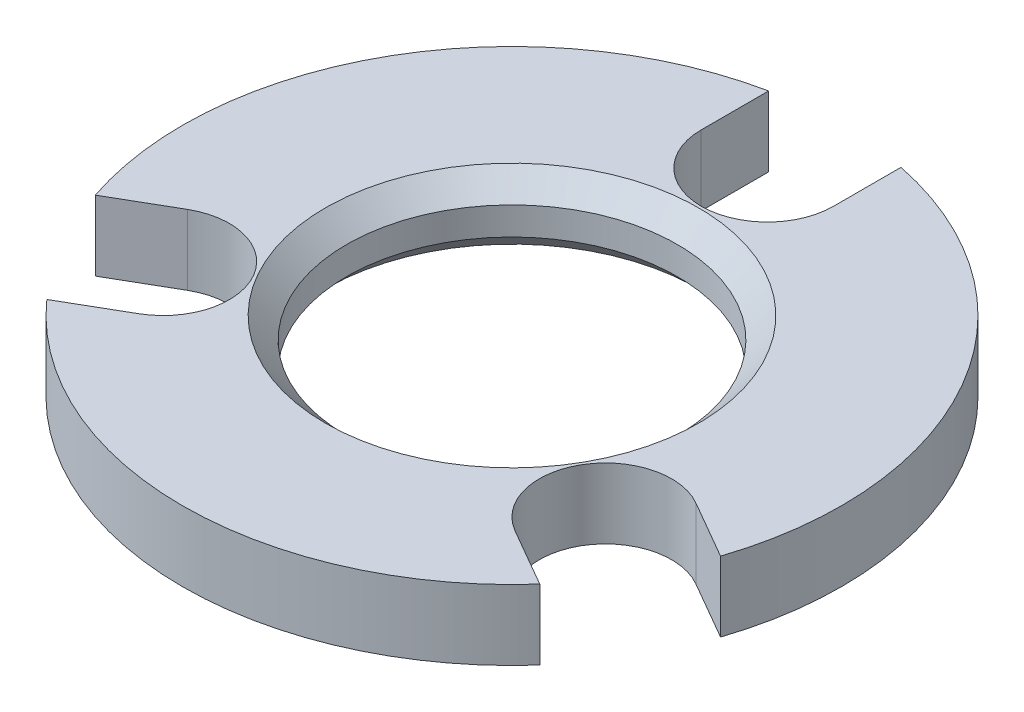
ISO-10303-21;
HEADER;
FILE_DESCRIPTION(('STEP AP214'),'2;1');
FILE_NAME('part.step','',(''),(''),'','','');
FILE_SCHEMA(('AUTOMOTIVE_DESIGN { 1 0 10303 214 1 1 1 1 }'));
ENDSEC;
DATA;
#1=APPLICATION_CONTEXT('core data for automotive mechanical design processes');
#2=APPLICATION_PROTOCOL_DEFINITION('international standard','automotive_design',2000,#1);
#3=PRODUCT_CONTEXT('',#1,'mechanical');
#4=PRODUCT('Part','Part','',(#3));
#5=PRODUCT_RELATED_PRODUCT_CATEGORY('part','',(#4));
#6=PRODUCT_DEFINITION_FORMATION('','',#4);
#7=PRODUCT_DEFINITION_CONTEXT('part definition',#1,'design');
#8=PRODUCT_DEFINITION('design','',#6,#7);
#9=PRODUCT_DEFINITION_SHAPE('','',#8);
#10=(LENGTH_UNIT() NAMED_UNIT(*) SI_UNIT(.MILLI.,.METRE.));
#11=(NAMED_UNIT(*) PLANE_ANGLE_UNIT() SI_UNIT($,.RADIAN.));
#12=(NAMED_UNIT(*) SI_UNIT($,.STERADIAN.) SOLID_ANGLE_UNIT());
#13=UNCERTAINTY_MEASURE_WITH_UNIT(LENGTH_MEASURE(1.E-05),#10,'distance_accuracy_value','');
#14=(GEOMETRIC_REPRESENTATION_CONTEXT(3) GLOBAL_UNCERTAINTY_ASSIGNED_CONTEXT((#13)) GLOBAL_UNIT_ASSIGNED_CONTEXT((#10,
#11,#12)) REPRESENTATION_CONTEXT('',''));
#15=CARTESIAN_POINT('',(0.,0.,0.));
#16=DIRECTION('',(0.,0.,1.));
#17=DIRECTION('',(1.,0.,0.));
#18=AXIS2_PLACEMENT_3D('',#15,#16,#17);
#19=CARTESIAN_POINT('',(0.,6.731,0.));
#20=DIRECTION('',(0.,-1.,0.));
#21=DIRECTION('',(0.,0.,-1.));
#22=AXIS2_PLACEMENT_3D('',#19,#20,#21);
#23=CYLINDRICAL_SURFACE('',#22,31.623);
#24=CARTESIAN_POINT('',(0.,6.731,0.));
#25=DIRECTION('',(0.,1.,0.));
#26=DIRECTION('',(0.,0.,1.));
#27=AXIS2_PLACEMENT_3D('',#24,#25,#26);
#28=CIRCLE('',#27,31.623);
#29=CARTESIAN_POINT('',(-23.6535057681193,6.731,20.98870634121));
#30=VERTEX_POINT('',#29);
#31=CARTESIAN_POINT('',(23.653505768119,6.731,20.9887063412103));
#32=VERTEX_POINT('',#31);
#33=EDGE_CURVE('E56',#30,#32,#28,.T.);
#34=ORIENTED_EDGE('',*,*,#33,.F.);
#35=DIRECTION('',(0.,-1.,0.));
#36=VECTOR('',#35,1.);
#37=CARTESIAN_POINT('',(-23.6535057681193,6.731,20.98870634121));
#38=LINE('',#37,#36);
#39=CARTESIAN_POINT('',(-23.6535057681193,0.,20.98870634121));
#40=VERTEX_POINT('',#39);
#41=EDGE_CURVE('E218',#30,#40,#38,.T.);
#42=ORIENTED_EDGE('',*,*,#41,.T.);
#43=CARTESIAN_POINT('',(0.,0.,0.));
#44=DIRECTION('',(0.,1.,0.));
#45=DIRECTION('',(0.,0.,1.));
#46=AXIS2_PLACEMENT_3D('',#43,#44,#45);
#47=CIRCLE('',#46,31.623);
#48=CARTESIAN_POINT('',(23.653505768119,0.,20.9887063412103));
#49=VERTEX_POINT('',#48);
#50=EDGE_CURVE('E205',#40,#49,#47,.T.);
#51=ORIENTED_EDGE('',*,*,#50,.T.);
#52=DIRECTION('',(0.,-1.,0.));
#53=VECTOR('',#52,1.);
#54=CARTESIAN_POINT('',(23.653505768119,6.731,20.9887063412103));
#55=LINE('',#54,#53);
#56=EDGE_CURVE('E211',#49,#32,#55,.F.);
#57=ORIENTED_EDGE('',*,*,#56,.T.);
#58=EDGE_LOOP('',(#34,#42,#51,#57));
#59=FACE_BOUND('',#58,.T.);
#60=ADVANCED_FACE('F33',(#59),#23,.T.);
#61=CARTESIAN_POINT('',(30.0035057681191,6.731,9.99018371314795));
#62=VERTEX_POINT('',#61);
#63=CARTESIAN_POINT('',(6.35,6.731,-30.978890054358));
#64=VERTEX_POINT('',#63);
#65=EDGE_CURVE('E202',#62,#64,#28,.T.);
#66=ORIENTED_EDGE('',*,*,#65,.F.);
#67=DIRECTION('',(0.,-1.,0.));
#68=VECTOR('',#67,1.);
#69=CARTESIAN_POINT('',(30.0035057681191,6.731,9.99018371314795));
#70=LINE('',#69,#68);
#71=CARTESIAN_POINT('',(30.0035057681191,0.,9.99018371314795));
#72=VERTEX_POINT('',#71);
#73=EDGE_CURVE('E214',#62,#72,#70,.T.);
#74=ORIENTED_EDGE('',*,*,#73,.T.);
#75=CARTESIAN_POINT('',(6.35,0.,-30.978890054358));
#76=VERTEX_POINT('',#75);
#77=EDGE_CURVE('E196',#72,#76,#47,.T.);
#78=ORIENTED_EDGE('',*,*,#77,.T.);
#79=DIRECTION('',(0.,-1.,0.));
#80=VECTOR('',#79,1.);
#81=CARTESIAN_POINT('',(6.35,6.731,-30.978890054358));
#82=LINE('',#81,#80);
#83=EDGE_CURVE('E201',#76,#64,#82,.F.);
#84=ORIENTED_EDGE('',*,*,#83,.T.);
#85=EDGE_LOOP('',(#66,#74,#78,#84));
#86=FACE_BOUND('',#85,.T.);
#87=ADVANCED_FACE('F247',(#86),#23,.T.);
#88=CARTESIAN_POINT('',(0.,6.731,0.));
#89=DIRECTION('',(0.,1.,0.));
#90=DIRECTION('',(0.,0.,1.));
#91=AXIS2_PLACEMENT_3D('',#88,#89,#90);
#92=PLANE('',#91);
#93=CARTESIAN_POINT('',(0.,6.731,0.));
#94=DIRECTION('',(0.,1.,0.));
#95=DIRECTION('',(0.,0.,1.));
#96=AXIS2_PLACEMENT_3D('',#93,#94,#95);
#97=CIRCLE('',#96,17.907);
#98=CARTESIAN_POINT('',(0.,6.731,17.907));
#99=VERTEX_POINT('',#98);
#100=EDGE_CURVE('E11',#99,#99,#97,.F.);
#101=ORIENTED_EDGE('',*,*,#100,.T.);
#102=EDGE_LOOP('',(#101));
#103=FACE_BOUND('',#102,.T.);
#104=DIRECTION('',(0.866025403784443,0.,-0.499999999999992));
#105=VECTOR('',#104,1.);
#106=CARTESIAN_POINT('',(-18.0521486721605,6.731,17.754761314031));
#107=LINE('',#106,#105);
#108=CARTESIAN_POINT('',(-18.0521486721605,6.731,17.754761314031));
#109=VERTEX_POINT('',#108);
#110=EDGE_CURVE('E146',#30,#109,#107,.T.);
#111=ORIENTED_EDGE('',*,*,#110,.F.);
#112=ORIENTED_EDGE('',*,*,#33,.T.);
#113=DIRECTION('',(0.866025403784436,0.,0.500000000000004));
#114=VECTOR('',#113,1.);
#115=CARTESIAN_POINT('',(24.2113213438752,6.731,21.3107613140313));
#116=LINE('',#115,#114);
#117=CARTESIAN_POINT('',(18.0521486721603,6.731,17.7547613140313));
#118=VERTEX_POINT('',#117);
#119=EDGE_CURVE('E168',#118,#32,#116,.T.);
#120=ORIENTED_EDGE('',*,*,#119,.F.);
#121=CARTESIAN_POINT('',(21.2271486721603,6.731,12.2555000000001));
#122=DIRECTION('',(0.,1.,0.));
#123=DIRECTION('',(-0.866025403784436,0.,-0.500000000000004));
#124=AXIS2_PLACEMENT_3D('',#121,#122,#123);
#125=CIRCLE('',#124,6.35);
#126=CARTESIAN_POINT('',(24.4021486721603,6.731,6.75623868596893));
#127=VERTEX_POINT('',#126);
#128=EDGE_CURVE('E153',#127,#118,#125,.T.);
#129=ORIENTED_EDGE('',*,*,#128,.F.);
#130=DIRECTION('',(-0.866025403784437,0.,-0.500000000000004));
#131=VECTOR('',#130,1.);
#132=CARTESIAN_POINT('',(24.4021486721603,6.731,6.75623868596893));
#133=LINE('',#132,#131);
#134=EDGE_CURVE('E159',#62,#127,#133,.T.);
#135=ORIENTED_EDGE('',*,*,#134,.F.);
#136=ORIENTED_EDGE('',*,*,#65,.T.);
#137=DIRECTION('',(0.,0.,-1.));
#138=VECTOR('',#137,1.);
#139=CARTESIAN_POINT('',(6.35,6.731,-31.623));
#140=LINE('',#139,#138);
#141=CARTESIAN_POINT('',(6.35,6.731,-24.511));
#142=VERTEX_POINT('',#141);
#143=EDGE_CURVE('E189',#142,#64,#140,.T.);
#144=ORIENTED_EDGE('',*,*,#143,.F.);
#145=CARTESIAN_POINT('',(0.,6.731,-24.511));
#146=DIRECTION('',(0.,1.,0.));
#147=DIRECTION('',(0.,0.,1.));
#148=AXIS2_PLACEMENT_3D('',#145,#146,#147);
#149=CIRCLE('',#148,6.35);
#150=CARTESIAN_POINT('',(-6.35,6.731,-24.511));
#151=VERTEX_POINT('',#150);
#152=EDGE_CURVE('E174',#151,#142,#149,.T.);
#153=ORIENTED_EDGE('',*,*,#152,.F.);
#154=DIRECTION('',(0.,0.,1.));
#155=VECTOR('',#154,1.);
#156=CARTESIAN_POINT('',(-6.35,6.731,-24.511));
#157=LINE('',#156,#155);
#158=CARTESIAN_POINT('',(-6.35,6.731,-30.978890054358));
#159=VERTEX_POINT('',#158);
#160=EDGE_CURVE('E180',#159,#151,#157,.T.);
#161=ORIENTED_EDGE('',*,*,#160,.F.);
#162=CARTESIAN_POINT('',(-30.0035057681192,6.731,9.99018371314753));
#163=VERTEX_POINT('',#162);
#164=EDGE_CURVE('E198',#159,#163,#28,.T.);
#165=ORIENTED_EDGE('',*,*,#164,.T.);
#166=DIRECTION('',(-0.866025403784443,0.,0.499999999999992));
#167=VECTOR('',#166,1.);
#168=CARTESIAN_POINT('',(-30.5613213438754,6.731,10.3122386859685));
#169=LINE('',#168,#167);
#170=CARTESIAN_POINT('',(-24.4021486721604,6.731,6.75623868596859));
#171=VERTEX_POINT('',#170);
#172=EDGE_CURVE('E48',#171,#163,#169,.T.);
#173=ORIENTED_EDGE('',*,*,#172,.F.);
#174=CARTESIAN_POINT('',(-21.2271486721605,6.731,12.2554999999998));
#175=DIRECTION('',(0.,1.,0.));
#176=DIRECTION('',(0.866025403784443,0.,-0.499999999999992));
#177=AXIS2_PLACEMENT_3D('',#174,#175,#176);
#178=CIRCLE('',#177,6.35);
#179=EDGE_CURVE('E132',#109,#171,#178,.T.);
#180=ORIENTED_EDGE('',*,*,#179,.F.);
#181=EDGE_LOOP('',(#111,#112,#120,#129,#135,#136,#144,#153,#161,#165,#173,#180));
#182=FACE_BOUND('',#181,.T.);
#183=ADVANCED_FACE('F239',(#103,#182),#92,.T.);
#184=CARTESIAN_POINT('',(0.,0.,0.));
#185=DIRECTION('',(0.,1.,0.));
#186=DIRECTION('',(0.,0.,1.));
#187=AXIS2_PLACEMENT_3D('',#184,#185,#186);
#188=PLANE('',#187);
#189=CARTESIAN_POINT('',(0.,0.,0.));
#190=DIRECTION('',(0.,1.,0.));
#191=DIRECTION('',(0.,0.,1.));
#192=AXIS2_PLACEMENT_3D('',#189,#190,#191);
#193=CIRCLE('',#192,17.907);
#194=CARTESIAN_POINT('',(0.,0.,17.907));
#195=VERTEX_POINT('',#194);
#196=EDGE_CURVE('E221',#195,#195,#193,.T.);
#197=ORIENTED_EDGE('',*,*,#196,.T.);
#198=EDGE_LOOP('',(#197));
#199=FACE_BOUND('',#198,.T.);
#200=ORIENTED_EDGE('',*,*,#50,.F.);
#201=DIRECTION('',(0.866025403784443,0.,-0.499999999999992));
#202=VECTOR('',#201,1.);
#203=CARTESIAN_POINT('',(-18.0521486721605,0.,17.754761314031));
#204=LINE('',#203,#202);
#205=CARTESIAN_POINT('',(-18.0521486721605,0.,17.754761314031));
#206=VERTEX_POINT('',#205);
#207=EDGE_CURVE('E134',#40,#206,#204,.T.);
#208=ORIENTED_EDGE('',*,*,#207,.T.);
#209=CARTESIAN_POINT('',(-21.2271486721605,0.,12.2554999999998));
#210=DIRECTION('',(0.,1.,0.));
#211=DIRECTION('',(0.866025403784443,0.,-0.499999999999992));
#212=AXIS2_PLACEMENT_3D('',#209,#210,#211);
#213=CIRCLE('',#212,6.35);
#214=CARTESIAN_POINT('',(-24.4021486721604,0.,6.75623868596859));
#215=VERTEX_POINT('',#214);
#216=EDGE_CURVE('E129',#206,#215,#213,.T.);
#217=ORIENTED_EDGE('',*,*,#216,.T.);
#218=DIRECTION('',(-0.866025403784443,0.,0.499999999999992));
#219=VECTOR('',#218,1.);
#220=CARTESIAN_POINT('',(-30.5613213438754,0.,10.3122386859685));
#221=LINE('',#220,#219);
#222=CARTESIAN_POINT('',(-30.0035057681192,0.,9.99018371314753));
#223=VERTEX_POINT('',#222);
#224=EDGE_CURVE('E137',#215,#223,#221,.T.);
#225=ORIENTED_EDGE('',*,*,#224,.T.);
#226=CARTESIAN_POINT('',(-6.35,0.,-30.978890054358));
#227=VERTEX_POINT('',#226);
#228=EDGE_CURVE('E203',#227,#223,#47,.T.);
#229=ORIENTED_EDGE('',*,*,#228,.F.);
#230=DIRECTION('',(0.,0.,1.));
#231=VECTOR('',#230,1.);
#232=CARTESIAN_POINT('',(-6.35,0.,-24.511));
#233=LINE('',#232,#231);
#234=CARTESIAN_POINT('',(-6.35,0.,-24.511));
#235=VERTEX_POINT('',#234);
#236=EDGE_CURVE('E183',#227,#235,#233,.T.);
#237=ORIENTED_EDGE('',*,*,#236,.T.);
#238=CARTESIAN_POINT('',(0.,0.,-24.511));
#239=DIRECTION('',(0.,1.,0.));
#240=DIRECTION('',(0.,0.,1.));
#241=AXIS2_PLACEMENT_3D('',#238,#239,#240);
#242=CIRCLE('',#241,6.35);
#243=CARTESIAN_POINT('',(6.35,0.,-24.511));
#244=VERTEX_POINT('',#243);
#245=EDGE_CURVE('E176',#235,#244,#242,.T.);
#246=ORIENTED_EDGE('',*,*,#245,.T.);
#247=DIRECTION('',(0.,0.,-1.));
#248=VECTOR('',#247,1.);
#249=CARTESIAN_POINT('',(6.35,0.,-31.623));
#250=LINE('',#249,#248);
#251=EDGE_CURVE('E179',#244,#76,#250,.T.);
#252=ORIENTED_EDGE('',*,*,#251,.T.);
#253=ORIENTED_EDGE('',*,*,#77,.F.);
#254=DIRECTION('',(-0.866025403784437,0.,-0.500000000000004));
#255=VECTOR('',#254,1.);
#256=CARTESIAN_POINT('',(24.4021486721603,0.,6.75623868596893));
#257=LINE('',#256,#255);
#258=CARTESIAN_POINT('',(24.4021486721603,0.,6.75623868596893));
#259=VERTEX_POINT('',#258);
#260=EDGE_CURVE('E162',#72,#259,#257,.T.);
#261=ORIENTED_EDGE('',*,*,#260,.T.);
#262=CARTESIAN_POINT('',(21.2271486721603,0.,12.2555000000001));
#263=DIRECTION('',(0.,1.,0.));
#264=DIRECTION('',(-0.866025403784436,0.,-0.500000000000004));
#265=AXIS2_PLACEMENT_3D('',#262,#263,#264);
#266=CIRCLE('',#265,6.35);
#267=CARTESIAN_POINT('',(18.0521486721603,0.,17.7547613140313));
#268=VERTEX_POINT('',#267);
#269=EDGE_CURVE('E155',#259,#268,#266,.T.);
#270=ORIENTED_EDGE('',*,*,#269,.T.);
#271=DIRECTION('',(0.866025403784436,0.,0.500000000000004));
#272=VECTOR('',#271,1.);
#273=CARTESIAN_POINT('',(24.2113213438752,0.,21.3107613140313));
#274=LINE('',#273,#272);
#275=EDGE_CURVE('E158',#268,#49,#274,.T.);
#276=ORIENTED_EDGE('',*,*,#275,.T.);
#277=EDGE_LOOP('',(#200,#208,#217,#225,#229,#237,#246,#252,#253,#261,#270,#276));
#278=FACE_BOUND('',#277,.T.);
#279=ADVANCED_FACE('F145',(#199,#278),#188,.F.);
#280=ORIENTED_EDGE('',*,*,#228,.T.);
#281=DIRECTION('',(0.,-1.,0.));
#282=VECTOR('',#281,1.);
#283=CARTESIAN_POINT('',(-30.0035057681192,6.731,9.99018371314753));
#284=LINE('',#283,#282);
#285=EDGE_CURVE('E139',#223,#163,#284,.F.);
#286=ORIENTED_EDGE('',*,*,#285,.T.);
#287=ORIENTED_EDGE('',*,*,#164,.F.);
#288=DIRECTION('',(0.,-1.,0.));
#289=VECTOR('',#288,1.);
#290=CARTESIAN_POINT('',(-6.35,6.731,-30.978890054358));
#291=LINE('',#290,#289);
#292=EDGE_CURVE('E208',#159,#227,#291,.T.);
#293=ORIENTED_EDGE('',*,*,#292,.T.);
#294=EDGE_LOOP('',(#280,#286,#287,#293));
#295=FACE_BOUND('',#294,.T.);
#296=ADVANCED_FACE('F238',(#295),#23,.T.);
#297=CARTESIAN_POINT('',(0.,6.731,0.));
#298=DIRECTION('',(0.,-1.,0.));
#299=DIRECTION('',(0.,0.,-1.));
#300=AXIS2_PLACEMENT_3D('',#297,#298,#299);
#301=CYLINDRICAL_SURFACE('',#300,15.875);
#302=CARTESIAN_POINT('',(0.,2.03200000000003,0.));
#303=DIRECTION('',(0.,1.,0.));
#304=DIRECTION('',(0.,0.,1.));
#305=AXIS2_PLACEMENT_3D('',#302,#303,#304);
#306=CIRCLE('',#305,15.875);
#307=CARTESIAN_POINT('',(0.,2.03200000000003,15.875));
#308=VERTEX_POINT('',#307);
#309=EDGE_CURVE('E41',#308,#308,#306,.F.);
#310=ORIENTED_EDGE('',*,*,#309,.T.);
#311=EDGE_LOOP('',(#310));
#312=FACE_BOUND('',#311,.T.);
#313=CARTESIAN_POINT('',(0.,4.69899999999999,0.));
#314=DIRECTION('',(0.,1.,0.));
#315=DIRECTION('',(0.,0.,1.));
#316=AXIS2_PLACEMENT_3D('',#313,#314,#315);
#317=CIRCLE('',#316,15.875);
#318=CARTESIAN_POINT('',(0.,4.69899999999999,15.875));
#319=VERTEX_POINT('',#318);
#320=EDGE_CURVE('E224',#319,#319,#317,.T.);
#321=ORIENTED_EDGE('',*,*,#320,.T.);
#322=EDGE_LOOP('',(#321));
#323=FACE_BOUND('',#322,.T.);
#324=ADVANCED_FACE('F229',(#312,#323),#301,.F.);
#325=CARTESIAN_POINT('',(-6.35,0.,-24.511));
#326=DIRECTION('',(-1.,0.,0.));
#327=DIRECTION('',(0.,0.,1.));
#328=AXIS2_PLACEMENT_3D('',#325,#326,#327);
#329=PLANE('',#328);
#330=ORIENTED_EDGE('',*,*,#160,.T.);
#331=DIRECTION('',(0.,1.,0.));
#332=VECTOR('',#331,1.);
#333=CARTESIAN_POINT('',(-6.35,0.,-24.511));
#334=LINE('',#333,#332);
#335=EDGE_CURVE('E193',#235,#151,#334,.T.);
#336=ORIENTED_EDGE('',*,*,#335,.F.);
#337=ORIENTED_EDGE('',*,*,#236,.F.);
#338=ORIENTED_EDGE('',*,*,#292,.F.);
#339=EDGE_LOOP('',(#330,#336,#337,#338));
#340=FACE_BOUND('',#339,.T.);
#341=ADVANCED_FACE('F291',(#340),#329,.F.);
#342=CARTESIAN_POINT('',(6.35,0.,-31.623));
#343=DIRECTION('',(1.,0.,0.));
#344=DIRECTION('',(0.,0.,-1.));
#345=AXIS2_PLACEMENT_3D('',#342,#343,#344);
#346=PLANE('',#345);
#347=ORIENTED_EDGE('',*,*,#251,.F.);
#348=DIRECTION('',(0.,1.,0.));
#349=VECTOR('',#348,1.);
#350=CARTESIAN_POINT('',(6.35,0.,-24.511));
#351=LINE('',#350,#349);
#352=EDGE_CURVE('E186',#244,#142,#351,.T.);
#353=ORIENTED_EDGE('',*,*,#352,.T.);
#354=ORIENTED_EDGE('',*,*,#143,.T.);
#355=ORIENTED_EDGE('',*,*,#83,.F.);
#356=EDGE_LOOP('',(#347,#353,#354,#355));
#357=FACE_BOUND('',#356,.T.);
#358=ADVANCED_FACE('F265',(#357),#346,.F.);
#359=CARTESIAN_POINT('',(0.,0.,-24.511));
#360=DIRECTION('',(0.,1.,0.));
#361=DIRECTION('',(0.,0.,1.));
#362=AXIS2_PLACEMENT_3D('',#359,#360,#361);
#363=CYLINDRICAL_SURFACE('',#362,6.35);
#364=ORIENTED_EDGE('',*,*,#152,.T.);
#365=ORIENTED_EDGE('',*,*,#352,.F.);
#366=ORIENTED_EDGE('',*,*,#245,.F.);
#367=ORIENTED_EDGE('',*,*,#335,.T.);
#368=EDGE_LOOP('',(#364,#365,#366,#367));
#369=FACE_BOUND('',#368,.T.);
#370=ADVANCED_FACE('F276',(#369),#363,.F.);
#371=CARTESIAN_POINT('',(24.4021486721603,0.,6.75623868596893));
#372=DIRECTION('',(0.500000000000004,0.,-0.866025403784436));
#373=DIRECTION('',(-0.866025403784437,0.,-0.500000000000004));
#374=AXIS2_PLACEMENT_3D('',#371,#372,#373);
#375=PLANE('',#374);
#376=ORIENTED_EDGE('',*,*,#134,.T.);
#377=DIRECTION('',(0.,1.,0.));
#378=VECTOR('',#377,1.);
#379=CARTESIAN_POINT('',(24.4021486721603,0.,6.75623868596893));
#380=LINE('',#379,#378);
#381=EDGE_CURVE('E171',#259,#127,#380,.T.);
#382=ORIENTED_EDGE('',*,*,#381,.F.);
#383=ORIENTED_EDGE('',*,*,#260,.F.);
#384=ORIENTED_EDGE('',*,*,#73,.F.);
#385=EDGE_LOOP('',(#376,#382,#383,#384));
#386=FACE_BOUND('',#385,.T.);
#387=ADVANCED_FACE('F274',(#386),#375,.F.);
#388=CARTESIAN_POINT('',(24.2113213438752,0.,21.3107613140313));
#389=DIRECTION('',(-0.500000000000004,0.,0.866025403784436));
#390=DIRECTION('',(0.866025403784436,0.,0.500000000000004));
#391=AXIS2_PLACEMENT_3D('',#388,#389,#390);
#392=PLANE('',#391);
#393=ORIENTED_EDGE('',*,*,#275,.F.);
#394=DIRECTION('',(0.,1.,0.));
#395=VECTOR('',#394,1.);
#396=CARTESIAN_POINT('',(18.0521486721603,0.,17.7547613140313));
#397=LINE('',#396,#395);
#398=EDGE_CURVE('E165',#268,#118,#397,.T.);
#399=ORIENTED_EDGE('',*,*,#398,.T.);
#400=ORIENTED_EDGE('',*,*,#119,.T.);
#401=ORIENTED_EDGE('',*,*,#56,.F.);
#402=EDGE_LOOP('',(#393,#399,#400,#401));
#403=FACE_BOUND('',#402,.T.);
#404=ADVANCED_FACE('F269',(#403),#392,.F.);
#405=CARTESIAN_POINT('',(21.2271486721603,0.,12.2555000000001));
#406=DIRECTION('',(0.,1.,0.));
#407=DIRECTION('',(0.,0.,1.));
#408=AXIS2_PLACEMENT_3D('',#405,#406,#407);
#409=CYLINDRICAL_SURFACE('',#408,6.35);
#410=ORIENTED_EDGE('',*,*,#128,.T.);
#411=ORIENTED_EDGE('',*,*,#398,.F.);
#412=ORIENTED_EDGE('',*,*,#269,.F.);
#413=ORIENTED_EDGE('',*,*,#381,.T.);
#414=EDGE_LOOP('',(#410,#411,#412,#413));
#415=FACE_BOUND('',#414,.T.);
#416=ADVANCED_FACE('F272',(#415),#409,.F.);
#417=CARTESIAN_POINT('',(-18.0521486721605,0.,17.754761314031));
#418=DIRECTION('',(0.499999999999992,0.,0.866025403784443));
#419=DIRECTION('',(0.866025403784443,0.,-0.499999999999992));
#420=AXIS2_PLACEMENT_3D('',#417,#418,#419);
#421=PLANE('',#420);
#422=ORIENTED_EDGE('',*,*,#110,.T.);
#423=DIRECTION('',(0.,1.,0.));
#424=VECTOR('',#423,1.);
#425=CARTESIAN_POINT('',(-18.0521486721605,0.,17.754761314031));
#426=LINE('',#425,#424);
#427=EDGE_CURVE('E133',#206,#109,#426,.T.);
#428=ORIENTED_EDGE('',*,*,#427,.F.);
#429=ORIENTED_EDGE('',*,*,#207,.F.);
#430=ORIENTED_EDGE('',*,*,#41,.F.);
#431=EDGE_LOOP('',(#422,#428,#429,#430));
#432=FACE_BOUND('',#431,.T.);
#433=ADVANCED_FACE('F290',(#432),#421,.F.);
#434=CARTESIAN_POINT('',(-30.5613213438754,0.,10.3122386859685));
#435=DIRECTION('',(-0.499999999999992,0.,-0.866025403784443));
#436=DIRECTION('',(-0.866025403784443,0.,0.499999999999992));
#437=AXIS2_PLACEMENT_3D('',#434,#435,#436);
#438=PLANE('',#437);
#439=ORIENTED_EDGE('',*,*,#224,.F.);
#440=DIRECTION('',(0.,1.,0.));
#441=VECTOR('',#440,1.);
#442=CARTESIAN_POINT('',(-24.4021486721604,0.,6.75623868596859));
#443=LINE('',#442,#441);
#444=EDGE_CURVE('E124',#215,#171,#443,.T.);
#445=ORIENTED_EDGE('',*,*,#444,.T.);
#446=ORIENTED_EDGE('',*,*,#172,.T.);
#447=ORIENTED_EDGE('',*,*,#285,.F.);
#448=EDGE_LOOP('',(#439,#445,#446,#447));
#449=FACE_BOUND('',#448,.T.);
#450=ADVANCED_FACE('F138',(#449),#438,.F.);
#451=CARTESIAN_POINT('',(-21.2271486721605,0.,12.2554999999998));
#452=DIRECTION('',(0.,1.,0.));
#453=DIRECTION('',(0.,0.,1.));
#454=AXIS2_PLACEMENT_3D('',#451,#452,#453);
#455=CYLINDRICAL_SURFACE('',#454,6.35);
#456=ORIENTED_EDGE('',*,*,#179,.T.);
#457=ORIENTED_EDGE('',*,*,#444,.F.);
#458=ORIENTED_EDGE('',*,*,#216,.F.);
#459=ORIENTED_EDGE('',*,*,#427,.T.);
#460=EDGE_LOOP('',(#456,#457,#458,#459));
#461=FACE_BOUND('',#460,.T.);
#462=ADVANCED_FACE('F126',(#461),#455,.F.);
#463=CARTESIAN_POINT('',(0.,0.,0.));
#464=DIRECTION('',(0.,-1.,0.));
#465=DIRECTION('',(0.,0.,-1.));
#466=AXIS2_PLACEMENT_3D('',#463,#464,#465);
#467=CONICAL_SURFACE('',#466,17.907,0.785398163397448);
#468=ORIENTED_EDGE('',*,*,#309,.F.);
#469=EDGE_LOOP('',(#468));
#470=FACE_BOUND('',#469,.T.);
#471=ORIENTED_EDGE('',*,*,#196,.F.);
#472=EDGE_LOOP('',(#471));
#473=FACE_BOUND('',#472,.T.);
#474=ADVANCED_FACE('F232',(#470,#473),#467,.F.);
#475=CARTESIAN_POINT('',(0.,4.69899999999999,0.));
#476=DIRECTION('',(0.,1.,0.));
#477=DIRECTION('',(0.,0.,1.));
#478=AXIS2_PLACEMENT_3D('',#475,#476,#477);
#479=CONICAL_SURFACE('',#478,15.875,0.785398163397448);
#480=ORIENTED_EDGE('',*,*,#100,.F.);
#481=EDGE_LOOP('',(#480));
#482=FACE_BOUND('',#481,.T.);
#483=ORIENTED_EDGE('',*,*,#320,.F.);
#484=EDGE_LOOP('',(#483));
#485=FACE_BOUND('',#484,.T.);
#486=ADVANCED_FACE('F35',(#482,#485),#479,.F.);
#487=CLOSED_SHELL('',(#60,#87,#183,#279,#296,#324,#341,#358,#370,#387,#404,#416,#433,#450,#462,
#474,#486));
#488=MANIFOLD_SOLID_BREP('B2',#487);
#489=ADVANCED_BREP_SHAPE_REPRESENTATION('',(#18,#488),#14);
#490=SHAPE_DEFINITION_REPRESENTATION(#9,#489);
ENDSEC;
END-ISO-10303-21;
